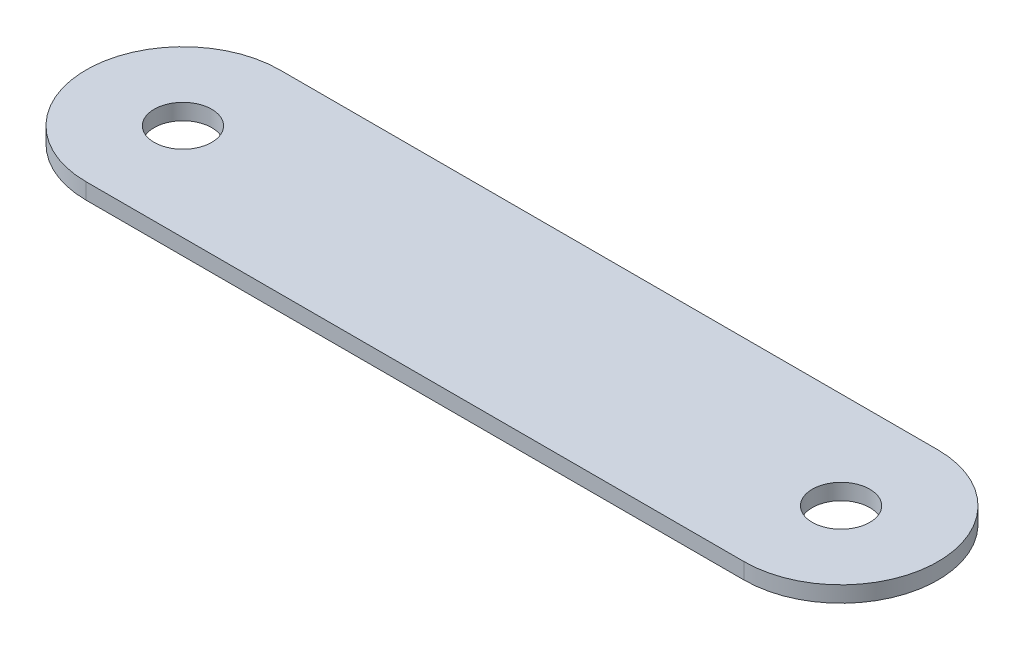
ISO-10303-21;
HEADER;
FILE_DESCRIPTION(('STEP AP214'),'2;1');
FILE_NAME('part.step','',(''),(''),'','','');
FILE_SCHEMA(('AUTOMOTIVE_DESIGN { 1 0 10303 214 1 1 1 1 }'));
ENDSEC;
DATA;
#1=APPLICATION_CONTEXT('core data for automotive mechanical design processes');
#2=APPLICATION_PROTOCOL_DEFINITION('international standard','automotive_design',2000,#1);
#3=PRODUCT_CONTEXT('',#1,'mechanical');
#4=PRODUCT('Part','Part','',(#3));
#5=PRODUCT_RELATED_PRODUCT_CATEGORY('part','',(#4));
#6=PRODUCT_DEFINITION_FORMATION('','',#4);
#7=PRODUCT_DEFINITION_CONTEXT('part definition',#1,'design');
#8=PRODUCT_DEFINITION('design','',#6,#7);
#9=PRODUCT_DEFINITION_SHAPE('','',#8);
#10=(LENGTH_UNIT() NAMED_UNIT(*) SI_UNIT(.MILLI.,.METRE.));
#11=(NAMED_UNIT(*) PLANE_ANGLE_UNIT() SI_UNIT($,.RADIAN.));
#12=(NAMED_UNIT(*) SI_UNIT($,.STERADIAN.) SOLID_ANGLE_UNIT());
#13=UNCERTAINTY_MEASURE_WITH_UNIT(LENGTH_MEASURE(1.E-05),#10,'distance_accuracy_value','');
#14=(GEOMETRIC_REPRESENTATION_CONTEXT(3) GLOBAL_UNCERTAINTY_ASSIGNED_CONTEXT((#13)) GLOBAL_UNIT_ASSIGNED_CONTEXT((#10,
#11,#12)) REPRESENTATION_CONTEXT('',''));
#15=CARTESIAN_POINT('',(0.,0.,0.));
#16=DIRECTION('',(0.,0.,1.));
#17=DIRECTION('',(1.,0.,0.));
#18=AXIS2_PLACEMENT_3D('',#15,#16,#17);
#19=CARTESIAN_POINT('',(-61.8,3.,0.));
#20=DIRECTION('',(0.,1.,0.));
#21=DIRECTION('',(0.,0.,1.));
#22=AXIS2_PLACEMENT_3D('',#19,#20,#21);
#23=PLANE('',#22);
#24=CARTESIAN_POINT('',(61.8,3.,0.));
#25=DIRECTION('',(0.,1.,0.));
#26=DIRECTION('',(0.,0.,-1.));
#27=AXIS2_PLACEMENT_3D('',#24,#25,#26);
#28=CIRCLE('',#27,5.4);
#29=CARTESIAN_POINT('',(61.8,3.,-5.40000000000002));
#30=VERTEX_POINT('',#29);
#31=EDGE_CURVE('E100',#30,#30,#28,.T.);
#32=ORIENTED_EDGE('',*,*,#31,.F.);
#33=EDGE_LOOP('',(#32));
#34=FACE_BOUND('',#33,.T.);
#35=CARTESIAN_POINT('',(-61.8,3.,0.));
#36=DIRECTION('',(0.,1.,0.));
#37=DIRECTION('',(0.,0.,1.));
#38=AXIS2_PLACEMENT_3D('',#35,#36,#37);
#39=CIRCLE('',#38,18.1930252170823);
#40=CARTESIAN_POINT('',(-61.8,3.,-18.1930252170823));
#41=VERTEX_POINT('',#40);
#42=CARTESIAN_POINT('',(-61.8,3.,18.1930252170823));
#43=VERTEX_POINT('',#42);
#44=EDGE_CURVE('E85',#41,#43,#39,.T.);
#45=ORIENTED_EDGE('',*,*,#44,.T.);
#46=DIRECTION('',(1.,0.,0.));
#47=VECTOR('',#46,1.);
#48=CARTESIAN_POINT('',(-61.8,3.,18.1930252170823));
#49=LINE('',#48,#47);
#50=CARTESIAN_POINT('',(61.8,3.,18.1930252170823));
#51=VERTEX_POINT('',#50);
#52=EDGE_CURVE('E80',#43,#51,#49,.T.);
#53=ORIENTED_EDGE('',*,*,#52,.T.);
#54=CARTESIAN_POINT('',(61.8,3.,0.));
#55=DIRECTION('',(0.,1.,0.));
#56=DIRECTION('',(0.,0.,1.));
#57=AXIS2_PLACEMENT_3D('',#54,#55,#56);
#58=CIRCLE('',#57,18.1930252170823);
#59=CARTESIAN_POINT('',(61.8,3.,-18.1930252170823));
#60=VERTEX_POINT('',#59);
#61=EDGE_CURVE('E83',#51,#60,#58,.T.);
#62=ORIENTED_EDGE('',*,*,#61,.T.);
#63=DIRECTION('',(-1.,0.,0.));
#64=VECTOR('',#63,1.);
#65=CARTESIAN_POINT('',(-61.8,3.,-18.1930252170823));
#66=LINE('',#65,#64);
#67=EDGE_CURVE('E50',#60,#41,#66,.T.);
#68=ORIENTED_EDGE('',*,*,#67,.T.);
#69=EDGE_LOOP('',(#45,#53,#62,#68));
#70=FACE_BOUND('',#69,.T.);
#71=CARTESIAN_POINT('',(-61.8,3.,0.));
#72=DIRECTION('',(0.,1.,0.));
#73=DIRECTION('',(0.,0.,1.));
#74=AXIS2_PLACEMENT_3D('',#71,#72,#73);
#75=CIRCLE('',#74,5.4);
#76=CARTESIAN_POINT('',(-61.8,3.,5.4));
#77=VERTEX_POINT('',#76);
#78=EDGE_CURVE('E115',#77,#77,#75,.T.);
#79=ORIENTED_EDGE('',*,*,#78,.F.);
#80=EDGE_LOOP('',(#79));
#81=FACE_BOUND('',#80,.T.);
#82=ADVANCED_FACE('F33',(#34,#70,#81),#23,.T.);
#83=CARTESIAN_POINT('',(-61.8,0.,0.));
#84=DIRECTION('',(0.,1.,0.));
#85=DIRECTION('',(0.,0.,1.));
#86=AXIS2_PLACEMENT_3D('',#83,#84,#85);
#87=PLANE('',#86);
#88=CARTESIAN_POINT('',(-61.8,0.,0.));
#89=DIRECTION('',(0.,1.,0.));
#90=DIRECTION('',(0.,0.,1.));
#91=AXIS2_PLACEMENT_3D('',#88,#89,#90);
#92=CIRCLE('',#91,18.1930252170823);
#93=CARTESIAN_POINT('',(-61.8,0.,-18.1930252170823));
#94=VERTEX_POINT('',#93);
#95=CARTESIAN_POINT('',(-61.8,0.,18.1930252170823));
#96=VERTEX_POINT('',#95);
#97=EDGE_CURVE('E97',#94,#96,#92,.T.);
#98=ORIENTED_EDGE('',*,*,#97,.F.);
#99=DIRECTION('',(-1.,0.,0.));
#100=VECTOR('',#99,1.);
#101=CARTESIAN_POINT('',(-61.8,0.,-18.1930252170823));
#102=LINE('',#101,#100);
#103=CARTESIAN_POINT('',(61.8,0.,-18.1930252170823));
#104=VERTEX_POINT('',#103);
#105=EDGE_CURVE('E73',#104,#94,#102,.T.);
#106=ORIENTED_EDGE('',*,*,#105,.F.);
#107=CARTESIAN_POINT('',(61.8,0.,0.));
#108=DIRECTION('',(0.,1.,0.));
#109=DIRECTION('',(0.,0.,1.));
#110=AXIS2_PLACEMENT_3D('',#107,#108,#109);
#111=CIRCLE('',#110,18.1930252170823);
#112=CARTESIAN_POINT('',(61.8,0.,18.1930252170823));
#113=VERTEX_POINT('',#112);
#114=EDGE_CURVE('E67',#113,#104,#111,.T.);
#115=ORIENTED_EDGE('',*,*,#114,.F.);
#116=DIRECTION('',(1.,0.,0.));
#117=VECTOR('',#116,1.);
#118=CARTESIAN_POINT('',(-61.8,0.,18.1930252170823));
#119=LINE('',#118,#117);
#120=EDGE_CURVE('E89',#96,#113,#119,.T.);
#121=ORIENTED_EDGE('',*,*,#120,.F.);
#122=EDGE_LOOP('',(#98,#106,#115,#121));
#123=FACE_BOUND('',#122,.T.);
#124=CARTESIAN_POINT('',(61.8,0.,0.));
#125=DIRECTION('',(0.,1.,0.));
#126=DIRECTION('',(0.,0.,-1.));
#127=AXIS2_PLACEMENT_3D('',#124,#125,#126);
#128=CIRCLE('',#127,5.4);
#129=CARTESIAN_POINT('',(61.8,0.,-5.40000000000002));
#130=VERTEX_POINT('',#129);
#131=EDGE_CURVE('E112',#130,#130,#128,.T.);
#132=ORIENTED_EDGE('',*,*,#131,.T.);
#133=EDGE_LOOP('',(#132));
#134=FACE_BOUND('',#133,.T.);
#135=CARTESIAN_POINT('',(-61.8,0.,0.));
#136=DIRECTION('',(0.,1.,0.));
#137=DIRECTION('',(0.,0.,1.));
#138=AXIS2_PLACEMENT_3D('',#135,#136,#137);
#139=CIRCLE('',#138,5.4);
#140=CARTESIAN_POINT('',(-61.8,0.,5.4));
#141=VERTEX_POINT('',#140);
#142=EDGE_CURVE('E118',#141,#141,#139,.T.);
#143=ORIENTED_EDGE('',*,*,#142,.T.);
#144=EDGE_LOOP('',(#143));
#145=FACE_BOUND('',#144,.T.);
#146=ADVANCED_FACE('F108',(#123,#134,#145),#87,.F.);
#147=CARTESIAN_POINT('',(-61.8,3.,0.));
#148=DIRECTION('',(0.,-1.,0.));
#149=DIRECTION('',(0.,0.,-1.));
#150=AXIS2_PLACEMENT_3D('',#147,#148,#149);
#151=CYLINDRICAL_SURFACE('',#150,18.1930252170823);
#152=ORIENTED_EDGE('',*,*,#97,.T.);
#153=DIRECTION('',(0.,-1.,0.));
#154=VECTOR('',#153,1.);
#155=CARTESIAN_POINT('',(-61.8,3.,18.1930252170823));
#156=LINE('',#155,#154);
#157=EDGE_CURVE('E11',#43,#96,#156,.T.);
#158=ORIENTED_EDGE('',*,*,#157,.F.);
#159=ORIENTED_EDGE('',*,*,#44,.F.);
#160=DIRECTION('',(0.,-1.,0.));
#161=VECTOR('',#160,1.);
#162=CARTESIAN_POINT('',(-61.8,3.,-18.1930252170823));
#163=LINE('',#162,#161);
#164=EDGE_CURVE('E93',#41,#94,#163,.T.);
#165=ORIENTED_EDGE('',*,*,#164,.T.);
#166=EDGE_LOOP('',(#152,#158,#159,#165));
#167=FACE_BOUND('',#166,.T.);
#168=ADVANCED_FACE('F35',(#167),#151,.T.);
#169=CARTESIAN_POINT('',(-61.8,3.,18.1930252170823));
#170=DIRECTION('',(0.,0.,-1.));
#171=DIRECTION('',(-1.,0.,0.));
#172=AXIS2_PLACEMENT_3D('',#169,#170,#171);
#173=PLANE('',#172);
#174=ORIENTED_EDGE('',*,*,#120,.T.);
#175=DIRECTION('',(0.,-1.,0.));
#176=VECTOR('',#175,1.);
#177=CARTESIAN_POINT('',(61.8,3.,18.1930252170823));
#178=LINE('',#177,#176);
#179=EDGE_CURVE('E42',#51,#113,#178,.T.);
#180=ORIENTED_EDGE('',*,*,#179,.F.);
#181=ORIENTED_EDGE('',*,*,#52,.F.);
#182=ORIENTED_EDGE('',*,*,#157,.T.);
#183=EDGE_LOOP('',(#174,#180,#181,#182));
#184=FACE_BOUND('',#183,.T.);
#185=ADVANCED_FACE('F88',(#184),#173,.F.);
#186=CARTESIAN_POINT('',(61.8,3.,0.));
#187=DIRECTION('',(0.,-1.,0.));
#188=DIRECTION('',(0.,0.,-1.));
#189=AXIS2_PLACEMENT_3D('',#186,#187,#188);
#190=CYLINDRICAL_SURFACE('',#189,18.1930252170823);
#191=ORIENTED_EDGE('',*,*,#114,.T.);
#192=DIRECTION('',(0.,-1.,0.));
#193=VECTOR('',#192,1.);
#194=CARTESIAN_POINT('',(61.8,3.,-18.1930252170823));
#195=LINE('',#194,#193);
#196=EDGE_CURVE('E90',#60,#104,#195,.T.);
#197=ORIENTED_EDGE('',*,*,#196,.F.);
#198=ORIENTED_EDGE('',*,*,#61,.F.);
#199=ORIENTED_EDGE('',*,*,#179,.T.);
#200=EDGE_LOOP('',(#191,#197,#198,#199));
#201=FACE_BOUND('',#200,.T.);
#202=ADVANCED_FACE('F91',(#201),#190,.T.);
#203=CARTESIAN_POINT('',(-61.8,3.,-18.1930252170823));
#204=DIRECTION('',(0.,0.,1.));
#205=DIRECTION('',(1.,0.,0.));
#206=AXIS2_PLACEMENT_3D('',#203,#204,#205);
#207=PLANE('',#206);
#208=ORIENTED_EDGE('',*,*,#105,.T.);
#209=ORIENTED_EDGE('',*,*,#164,.F.);
#210=ORIENTED_EDGE('',*,*,#67,.F.);
#211=ORIENTED_EDGE('',*,*,#196,.T.);
#212=EDGE_LOOP('',(#208,#209,#210,#211));
#213=FACE_BOUND('',#212,.T.);
#214=ADVANCED_FACE('F105',(#213),#207,.F.);
#215=CARTESIAN_POINT('',(61.8,3.,0.));
#216=DIRECTION('',(0.,-1.,0.));
#217=DIRECTION('',(0.,0.,-1.));
#218=AXIS2_PLACEMENT_3D('',#215,#216,#217);
#219=CYLINDRICAL_SURFACE('',#218,5.4);
#220=ORIENTED_EDGE('',*,*,#31,.T.);
#221=EDGE_LOOP('',(#220));
#222=FACE_BOUND('',#221,.T.);
#223=ORIENTED_EDGE('',*,*,#131,.F.);
#224=EDGE_LOOP('',(#223));
#225=FACE_BOUND('',#224,.T.);
#226=ADVANCED_FACE('F135',(#222,#225),#219,.F.);
#227=CARTESIAN_POINT('',(-61.8,3.,0.));
#228=DIRECTION('',(0.,-1.,0.));
#229=DIRECTION('',(0.,0.,-1.));
#230=AXIS2_PLACEMENT_3D('',#227,#228,#229);
#231=CYLINDRICAL_SURFACE('',#230,5.4);
#232=ORIENTED_EDGE('',*,*,#78,.T.);
#233=EDGE_LOOP('',(#232));
#234=FACE_BOUND('',#233,.T.);
#235=ORIENTED_EDGE('',*,*,#142,.F.);
#236=EDGE_LOOP('',(#235));
#237=FACE_BOUND('',#236,.T.);
#238=ADVANCED_FACE('F124',(#234,#237),#231,.F.);
#239=CLOSED_SHELL('',(#82,#146,#168,#185,#202,#214,#226,#238));
#240=MANIFOLD_SOLID_BREP('B2',#239);
#241=ADVANCED_BREP_SHAPE_REPRESENTATION('',(#18,#240),#14);
#242=SHAPE_DEFINITION_REPRESENTATION(#9,#241);
ENDSEC;
END-ISO-10303-21;
